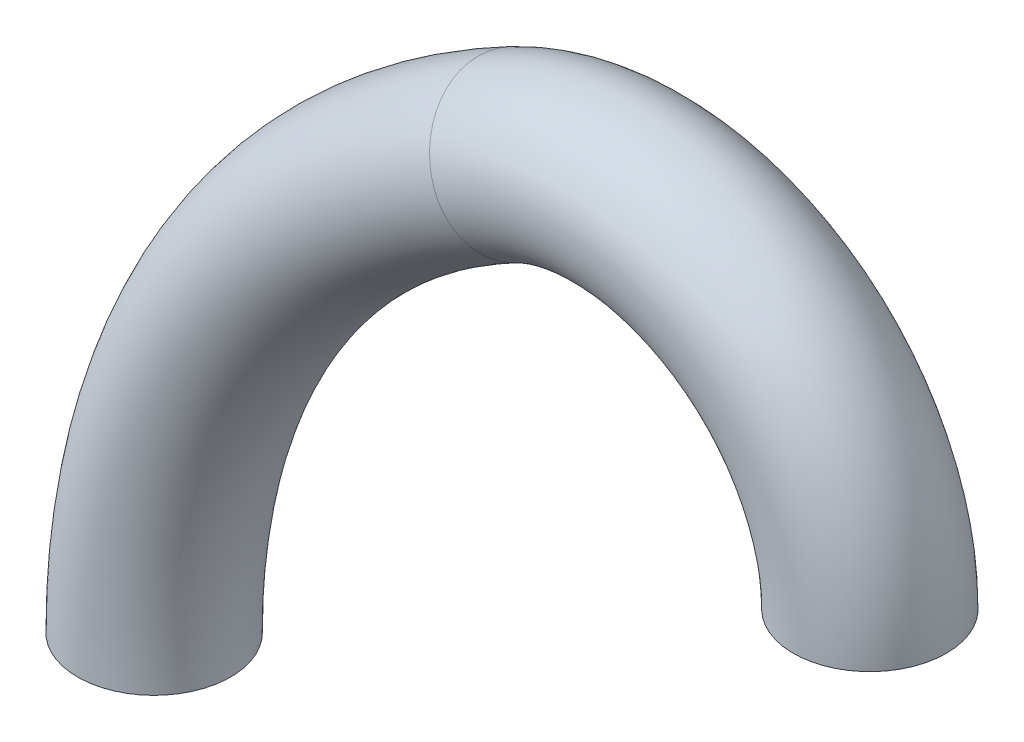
ISO-10303-21;
HEADER;
FILE_DESCRIPTION(('STEP AP214'),'2;1');
FILE_NAME('part.step','',(''),(''),'','','');
FILE_SCHEMA(('AUTOMOTIVE_DESIGN { 1 0 10303 214 1 1 1 1 }'));
ENDSEC;
DATA;
#1=APPLICATION_CONTEXT('core data for automotive mechanical design processes');
#2=APPLICATION_PROTOCOL_DEFINITION('international standard','automotive_design',2000,#1);
#3=PRODUCT_CONTEXT('',#1,'mechanical');
#4=PRODUCT('Part','Part','',(#3));
#5=PRODUCT_RELATED_PRODUCT_CATEGORY('part','',(#4));
#6=PRODUCT_DEFINITION_FORMATION('','',#4);
#7=PRODUCT_DEFINITION_CONTEXT('part definition',#1,'design');
#8=PRODUCT_DEFINITION('design','',#6,#7);
#9=PRODUCT_DEFINITION_SHAPE('','',#8);
#10=(LENGTH_UNIT() NAMED_UNIT(*) SI_UNIT(.MILLI.,.METRE.));
#11=(NAMED_UNIT(*) PLANE_ANGLE_UNIT() SI_UNIT($,.RADIAN.));
#12=(NAMED_UNIT(*) SI_UNIT($,.STERADIAN.) SOLID_ANGLE_UNIT());
#13=UNCERTAINTY_MEASURE_WITH_UNIT(LENGTH_MEASURE(1.E-05),#10,'distance_accuracy_value','');
#14=(GEOMETRIC_REPRESENTATION_CONTEXT(3) GLOBAL_UNCERTAINTY_ASSIGNED_CONTEXT((#13)) GLOBAL_UNIT_ASSIGNED_CONTEXT((#10,
#11,#12)) REPRESENTATION_CONTEXT('',''));
#15=CARTESIAN_POINT('',(0.,0.,0.));
#16=DIRECTION('',(0.,0.,1.));
#17=DIRECTION('',(1.,0.,0.));
#18=AXIS2_PLACEMENT_3D('',#15,#16,#17);
#19=CARTESIAN_POINT('',(24.4981288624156,19.6214999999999,0.));
#20=DIRECTION('',(0.,0.,-0.999999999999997));
#21=DIRECTION('',(-0.999999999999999,0.,0.));
#22=AXIS2_PLACEMENT_3D('',#19,#20,#21);
#23=TOROIDAL_SURFACE('',#22,12.6153615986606,3.96875);
#24=CARTESIAN_POINT('',(18.6531187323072,30.8010887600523,1.2490009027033E-13));
#25=DIRECTION('',(0.886188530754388,0.463324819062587,0.));
#26=DIRECTION('',(0.,0.,0.999999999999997));
#27=AXIS2_PLACEMENT_3D('',#24,#25,#26);
#28=CIRCLE('',#27,3.96875);
#29=CARTESIAN_POINT('',(16.8142983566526,34.3181494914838,1.51095520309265E-13));
#30=VERTEX_POINT('',#29);
#31=EDGE_CURVE('E34',#30,#30,#28,.T.);
#32=CARTESIAN_POINT('',(37.1134904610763,19.6215,0.));
#33=DIRECTION('',(0.,-1.,0.));
#34=DIRECTION('',(0.,0.,0.999999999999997));
#35=AXIS2_PLACEMENT_3D('',#32,#33,#34);
#36=CIRCLE('',#35,3.96875);
#37=CARTESIAN_POINT('',(41.0822404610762,19.6215,0.));
#38=VERTEX_POINT('',#37);
#39=EDGE_CURVE('E10',#38,#38,#36,.T.);
#40=CARTESIAN_POINT('',(24.4981288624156,19.6214999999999,0.));
#41=DIRECTION('',(0.,0.,-0.999999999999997));
#42=DIRECTION('',(-0.999999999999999,0.,0.));
#43=AXIS2_PLACEMENT_3D('',#40,#41,#42);
#44=CIRCLE('',#43,16.5841115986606);
#45=EDGE_CURVE('',#30,#38,#44,.T.);
#46=ORIENTED_EDGE('',*,*,#31,.T.);
#47=ORIENTED_EDGE('',*,*,#39,.F.);
#48=ORIENTED_EDGE('',*,*,#45,.T.);
#49=ORIENTED_EDGE('',*,*,#45,.F.);
#50=EDGE_LOOP('',(#46,#48,#47,#49));
#51=FACE_BOUND('',#50,.T.);
#52=ADVANCED_FACE('F28',(#51),#23,.T.);
#53=CARTESIAN_POINT('',(34.7568126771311,-1.52655665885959E-13,0.));
#54=DIRECTION('',(0.,0.,0.999999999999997));
#55=DIRECTION('',(0.999999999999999,0.,0.));
#56=AXIS2_PLACEMENT_3D('',#53,#54,#55);
#57=TOROIDAL_SURFACE('',#56,34.7568126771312,3.96875);
#58=CARTESIAN_POINT('',(0.,0.,0.));
#59=DIRECTION('',(0.,1.,0.));
#60=DIRECTION('',(0.,0.,0.999999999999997));
#61=AXIS2_PLACEMENT_3D('',#58,#59,#60);
#62=CIRCLE('',#61,3.96875);
#63=CARTESIAN_POINT('',(-3.96875000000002,0.,0.));
#64=VERTEX_POINT('',#63);
#65=EDGE_CURVE('E38',#64,#64,#62,.T.);
#66=CARTESIAN_POINT('',(34.7568126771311,-1.52655665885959E-13,0.));
#67=DIRECTION('',(0.,0.,0.999999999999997));
#68=DIRECTION('',(0.999999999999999,0.,0.));
#69=AXIS2_PLACEMENT_3D('',#66,#67,#68);
#70=CIRCLE('',#69,38.7255626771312);
#71=EDGE_CURVE('',#30,#64,#70,.T.);
#72=ORIENTED_EDGE('',*,*,#31,.F.);
#73=ORIENTED_EDGE('',*,*,#65,.T.);
#74=ORIENTED_EDGE('',*,*,#71,.T.);
#75=ORIENTED_EDGE('',*,*,#71,.F.);
#76=EDGE_LOOP('',(#72,#74,#73,#75));
#77=FACE_BOUND('',#76,.T.);
#78=ADVANCED_FACE('F45',(#77),#57,.T.);
#79=CARTESIAN_POINT('',(37.1134904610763,19.6215,0.));
#80=DIRECTION('',(0.,-1.,0.));
#81=DIRECTION('',(0.,0.,0.999999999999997));
#82=AXIS2_PLACEMENT_3D('',#79,#80,#81);
#83=PLANE('',#82);
#84=ORIENTED_EDGE('',*,*,#39,.T.);
#85=EDGE_LOOP('',(#84));
#86=FACE_BOUND('',#85,.T.);
#87=ADVANCED_FACE('F49',(#86),#83,.T.);
#88=CARTESIAN_POINT('',(0.,0.,0.));
#89=DIRECTION('',(0.,1.,0.));
#90=DIRECTION('',(0.,0.,0.999999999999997));
#91=AXIS2_PLACEMENT_3D('',#88,#89,#90);
#92=PLANE('',#91);
#93=ORIENTED_EDGE('',*,*,#65,.F.);
#94=EDGE_LOOP('',(#93));
#95=FACE_BOUND('',#94,.T.);
#96=ADVANCED_FACE('F47',(#95),#92,.F.);
#97=CLOSED_SHELL('',(#52,#78,#87,#96));
#98=MANIFOLD_SOLID_BREP('B2',#97);
#99=ADVANCED_BREP_SHAPE_REPRESENTATION('',(#18,#98),#14);
#100=SHAPE_DEFINITION_REPRESENTATION(#9,#99);
ENDSEC;
END-ISO-10303-21;
